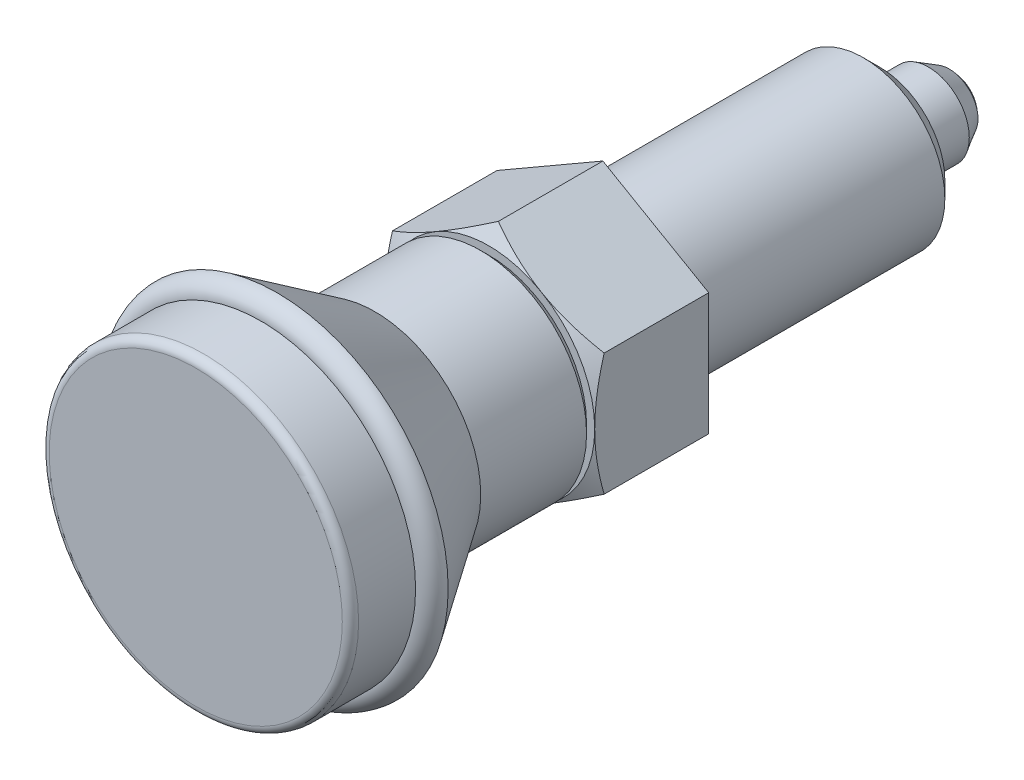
ISO-10303-21;
HEADER;
FILE_DESCRIPTION(('STEP AP214'),'2;1');
FILE_NAME('part.step','',(''),(''),'','','');
FILE_SCHEMA(('AUTOMOTIVE_DESIGN { 1 0 10303 214 1 1 1 1 }'));
ENDSEC;
DATA;
#1=APPLICATION_CONTEXT('core data for automotive mechanical design processes');
#2=APPLICATION_PROTOCOL_DEFINITION('international standard','automotive_design',2000,#1);
#3=PRODUCT_CONTEXT('',#1,'mechanical');
#4=PRODUCT('Part','Part','',(#3));
#5=PRODUCT_RELATED_PRODUCT_CATEGORY('part','',(#4));
#6=PRODUCT_DEFINITION_FORMATION('','',#4);
#7=PRODUCT_DEFINITION_CONTEXT('part definition',#1,'design');
#8=PRODUCT_DEFINITION('design','',#6,#7);
#9=PRODUCT_DEFINITION_SHAPE('','',#8);
#10=(LENGTH_UNIT() NAMED_UNIT(*) SI_UNIT(.MILLI.,.METRE.));
#11=(NAMED_UNIT(*) PLANE_ANGLE_UNIT() SI_UNIT($,.RADIAN.));
#12=(NAMED_UNIT(*) SI_UNIT($,.STERADIAN.) SOLID_ANGLE_UNIT());
#13=UNCERTAINTY_MEASURE_WITH_UNIT(LENGTH_MEASURE(1.E-05),#10,'distance_accuracy_value','');
#14=(GEOMETRIC_REPRESENTATION_CONTEXT(3) GLOBAL_UNCERTAINTY_ASSIGNED_CONTEXT((#13)) GLOBAL_UNIT_ASSIGNED_CONTEXT((#10,
#11,#12)) REPRESENTATION_CONTEXT('',''));
#15=CARTESIAN_POINT('',(0.,0.,0.));
#16=DIRECTION('',(0.,0.,1.));
#17=DIRECTION('',(1.,0.,0.));
#18=AXIS2_PLACEMENT_3D('',#15,#16,#17);
#19=CARTESIAN_POINT('',(2.59480249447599E-10,-1.49809602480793E-10,7.));
#20=DIRECTION('',(-3.70686070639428E-11,2.14013717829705E-11,-1.));
#21=DIRECTION('',(-1.,0.,3.70686070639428E-11));
#22=AXIS2_PLACEMENT_3D('',#19,#20,#21);
#23=CONICAL_SURFACE('',#22,6.49999999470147,1.0471975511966);
#24=CARTESIAN_POINT('',(6.50020000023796,3.75266127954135,6.41937674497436));
#25=CARTESIAN_POINT('',(6.35732254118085,3.83515161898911,6.46699557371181));
#26=CARTESIAN_POINT('',(6.2139123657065,3.91794952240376,6.51245329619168));
#27=CARTESIAN_POINT('',(5.92592736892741,4.08421773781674,6.59845131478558));
#28=CARTESIAN_POINT('',(5.78135207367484,4.16768832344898,6.63898948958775));
#29=CARTESIAN_POINT('',(5.34531134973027,4.41943655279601,6.75242899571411));
#30=CARTESIAN_POINT('',(5.05212471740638,4.58870793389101,6.81695218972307));
#31=CARTESIAN_POINT('',(4.61337625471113,4.84201947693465,6.89261341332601));
#32=CARTESIAN_POINT('',(4.46912536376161,4.9253027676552,6.91416714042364));
#33=CARTESIAN_POINT('',(4.17997178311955,5.09224566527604,6.9503096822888));
#34=CARTESIAN_POINT('',(4.03506915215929,5.17590523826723,6.96489911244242));
#35=CARTESIAN_POINT('',(3.74501222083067,5.34336968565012,6.98674124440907));
#36=CARTESIAN_POINT('',(3.59985839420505,5.42717428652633,6.99400227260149));
#37=CARTESIAN_POINT('',(3.30942466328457,5.59485627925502,7.00103969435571));
#38=CARTESIAN_POINT('',(3.16414476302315,5.67873366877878,7.00081631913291));
#39=CARTESIAN_POINT('',(2.76612405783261,5.90853103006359,6.98991653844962));
#40=CARTESIAN_POINT('',(2.51351353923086,6.05437578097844,6.97161817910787));
#41=CARTESIAN_POINT('',(2.0099703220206,6.3450965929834,6.9135936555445));
#42=CARTESIAN_POINT('',(1.75903939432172,6.48997163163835,6.87384765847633));
#43=CARTESIAN_POINT('',(1.2544827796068,6.78127752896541,6.77449409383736));
#44=CARTESIAN_POINT('',(1.00092075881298,6.92767162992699,6.71446557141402));
#45=CARTESIAN_POINT('',(0.497578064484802,7.21827666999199,6.57822500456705));
#46=CARTESIAN_POINT('',(0.24779094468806,7.36249133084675,6.50204496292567));
#47=CARTESIAN_POINT('',(-0.000199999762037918,7.5056689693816,6.41937674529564));
#48=B_SPLINE_CURVE_WITH_KNOTS('',3,(#24,#25,#26,#27,#28,#29,#30,#31,#32,#33,#34,#35,#36,#37,#38,
#39,#40,#41,#42,#43,#44,#45,#46,#47),.UNSPECIFIED.,.F.,.F.,(4,2,2,2,2,2,2,2,2,2,2,4),(0.,
0.51510505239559,1.03043143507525,2.06322554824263,2.56697389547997,3.07067772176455,
3.57380860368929,4.07692394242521,4.95279354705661,5.82947446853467,6.72559912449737,
7.61996451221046),.UNSPECIFIED.);
#49=CARTESIAN_POINT('',(3.25000000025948,5.62916512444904,7.));
#50=VERTEX_POINT('',#49);
#51=CARTESIAN_POINT('',(0.,7.50555349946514,6.41944341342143));
#52=VERTEX_POINT('',#51);
#53=EDGE_CURVE('E103',#50,#52,#48,.T.);
#54=ORIENTED_EDGE('',*,*,#53,.T.);
#55=CARTESIAN_POINT('',(0.000200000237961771,7.5056689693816,6.41937674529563));
#56=CARTESIAN_POINT('',(-0.142677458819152,7.42317862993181,6.46699557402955));
#57=CARTESIAN_POINT('',(-0.286087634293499,7.34038072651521,6.51245329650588));
#58=CARTESIAN_POINT('',(-0.574072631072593,7.17411251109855,6.59845131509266));
#59=CARTESIAN_POINT('',(-0.71864792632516,7.09064192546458,6.63898948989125));
#60=CARTESIAN_POINT('',(-1.15468865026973,6.83889369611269,6.75242899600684));
#61=CARTESIAN_POINT('',(-1.44787528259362,6.66962231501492,6.81695219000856));
#62=CARTESIAN_POINT('',(-1.88662374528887,6.41631077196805,6.89261341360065));
#63=CARTESIAN_POINT('',(-2.03087463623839,6.33302748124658,6.91416714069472));
#64=CARTESIAN_POINT('',(-2.32002821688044,6.1660845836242,6.95030968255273));
#65=CARTESIAN_POINT('',(-2.46493084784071,6.08242501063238,6.96489911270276));
#66=CARTESIAN_POINT('',(-2.75498777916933,5.91496056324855,6.98674124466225));
#67=CARTESIAN_POINT('',(-2.90014160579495,5.83115596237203,6.99400227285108));
#68=CARTESIAN_POINT('',(-3.19057533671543,5.66347396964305,7.00103969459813));
#69=CARTESIAN_POINT('',(-3.33585523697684,5.57959658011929,7.00081631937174));
#70=CARTESIAN_POINT('',(-3.73387594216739,5.34979921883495,6.98991653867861));
#71=CARTESIAN_POINT('',(-3.98648646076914,5.20395446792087,6.97161817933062));
#72=CARTESIAN_POINT('',(-4.4900296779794,4.9132336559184,6.91359365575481));
#73=CARTESIAN_POINT('',(-4.74096060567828,4.76835861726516,6.87384765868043));
#74=CARTESIAN_POINT('',(-5.2455172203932,4.47705271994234,6.774494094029));
#75=CARTESIAN_POINT('',(-5.49907924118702,4.33065861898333,6.71446557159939));
#76=CARTESIAN_POINT('',(-6.0024219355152,4.04005357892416,6.57822500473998));
#77=CARTESIAN_POINT('',(-6.25220905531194,3.89583891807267,6.50204496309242));
#78=CARTESIAN_POINT('',(-6.50019999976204,3.75266127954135,6.41937674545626));
#79=B_SPLINE_CURVE_WITH_KNOTS('',3,(#55,#56,#57,#58,#59,#60,#61,#62,#63,#64,#65,#66,#67,#68,#69,
#70,#71,#72,#73,#74,#75,#76,#77,#78),.UNSPECIFIED.,.F.,.F.,(4,2,2,2,2,2,2,2,2,2,2,4),(0.,
0.515105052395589,1.03043143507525,2.06322554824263,2.56697389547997,3.07067772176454,
3.57380860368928,4.07692394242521,4.95279354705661,5.82947446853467,6.72559912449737,
7.61996451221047),.UNSPECIFIED.);
#80=CARTESIAN_POINT('',(-3.24999999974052,5.62916512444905,7.00000000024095));
#81=VERTEX_POINT('',#80);
#82=EDGE_CURVE('E93',#52,#81,#79,.T.);
#83=ORIENTED_EDGE('',*,*,#82,.T.);
#84=CARTESIAN_POINT('',(2.59480249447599E-10,-1.49809602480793E-10,7.));
#85=DIRECTION('',(3.70686070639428E-11,-2.14013717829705E-11,1.));
#86=DIRECTION('',(1.,0.,-3.70686070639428E-11));
#87=AXIS2_PLACEMENT_3D('',#84,#85,#86);
#88=CIRCLE('',#87,6.49999999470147);
#89=EDGE_CURVE('E269',#50,#81,#88,.T.);
#90=ORIENTED_EDGE('',*,*,#89,.F.);
#91=EDGE_LOOP('',(#54,#83,#90));
#92=FACE_BOUND('',#91,.T.);
#93=ADVANCED_FACE('F15',(#92),#23,.T.);
#94=CARTESIAN_POINT('',(-6.49999999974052,-1.4980960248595E-10,7.00000000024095));
#95=VERTEX_POINT('',#94);
#96=EDGE_CURVE('E277',#81,#95,#88,.T.);
#97=ORIENTED_EDGE('',*,*,#96,.F.);
#98=CARTESIAN_POINT('',(-6.49999999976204,3.75277674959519,6.41944341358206));
#99=VERTEX_POINT('',#98);
#100=EDGE_CURVE('E192',#81,#99,#79,.T.);
#101=ORIENTED_EDGE('',*,*,#100,.T.);
#102=CARTESIAN_POINT('',(-6.49999999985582,-9.95291698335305,3.88957641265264));
#103=CARTESIAN_POINT('',(-6.49999999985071,-9.66753022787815,4.02749105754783));
#104=CARTESIAN_POINT('',(-6.49999999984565,-9.38146872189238,4.16403471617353));
#105=CARTESIAN_POINT('',(-6.49999999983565,-8.80763137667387,4.43359663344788));
#106=CARTESIAN_POINT('',(-6.49999999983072,-8.51985525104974,4.56661428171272));
#107=CARTESIAN_POINT('',(-6.499999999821,-7.94066929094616,4.82904149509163));
#108=CARTESIAN_POINT('',(-6.4999999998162,-7.64924808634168,4.95842605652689));
#109=CARTESIAN_POINT('',(-6.49999999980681,-7.06401043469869,5.21163779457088));
#110=CARTESIAN_POINT('',(-6.49999999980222,-6.77019411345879,5.33546526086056));
#111=CARTESIAN_POINT('',(-6.49999999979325,-6.1760515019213,5.57755519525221));
#112=CARTESIAN_POINT('',(-6.49999999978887,-5.87568957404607,5.69573067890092));
#113=CARTESIAN_POINT('',(-6.49999999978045,-5.27142269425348,5.92282610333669));
#114=CARTESIAN_POINT('',(-6.49999999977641,-4.96751735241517,6.03174501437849));
#115=CARTESIAN_POINT('',(-6.49999999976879,-4.3563054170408,6.23740097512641));
#116=CARTESIAN_POINT('',(-6.4999999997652,-4.04900762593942,6.33416392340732));
#117=CARTESIAN_POINT('',(-6.4999999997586,-3.43004022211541,6.51236428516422));
#118=CARTESIAN_POINT('',(-6.49999999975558,-3.11837202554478,6.59380654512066));
#119=CARTESIAN_POINT('',(-6.49999999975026,-2.49046594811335,6.73741591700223));
#120=CARTESIAN_POINT('',(-6.49999999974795,-2.1742268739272,6.79957789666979));
#121=CARTESIAN_POINT('',(-6.49999999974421,-1.53789167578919,6.9004257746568));
#122=CARTESIAN_POINT('',(-6.49999999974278,-1.21779554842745,6.93911165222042));
#123=CARTESIAN_POINT('',(-6.49999999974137,-0.737141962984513,6.97705343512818));
#124=CARTESIAN_POINT('',(-6.49999999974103,-0.577336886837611,6.98635478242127));
#125=CARTESIAN_POINT('',(-6.49999999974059,-0.257468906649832,6.99818590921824));
#126=CARTESIAN_POINT('',(-6.49999999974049,-0.0974060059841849,7.00071577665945));
#127=CARTESIAN_POINT('',(-6.49999999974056,0.222635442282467,6.99893598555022));
#128=CARTESIAN_POINT('',(-6.49999999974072,0.382614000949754,6.99462824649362));
#129=CARTESIAN_POINT('',(-6.49999999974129,0.702250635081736,6.97928241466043));
#130=CARTESIAN_POINT('',(-6.4999999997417,0.86190869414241,6.96824398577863));
#131=CARTESIAN_POINT('',(-6.49999999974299,1.24887053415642,6.933563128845));
#132=CARTESIAN_POINT('',(-6.49999999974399,1.47587694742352,6.90654811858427));
#133=CARTESIAN_POINT('',(-6.49999999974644,1.92815030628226,6.84041010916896));
#134=CARTESIAN_POINT('',(-6.49999999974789,2.15341675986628,6.8012838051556));
#135=CARTESIAN_POINT('',(-6.49999999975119,2.6020242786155,6.71231082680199));
#136=CARTESIAN_POINT('',(-6.49999999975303,2.82536331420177,6.66245401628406));
#137=CARTESIAN_POINT('',(-6.49999999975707,3.26974354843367,6.55354123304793));
#138=CARTESIAN_POINT('',(-6.49999999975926,3.49078496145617,6.49448612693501));
#139=CARTESIAN_POINT('',(-6.49999999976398,3.93601414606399,6.36704588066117));
#140=CARTESIAN_POINT('',(-6.49999999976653,4.16014622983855,6.2984675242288));
#141=CARTESIAN_POINT('',(-6.49999999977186,4.60604131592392,6.15453487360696));
#142=CARTESIAN_POINT('',(-6.49999999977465,4.82780583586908,6.07918525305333));
#143=CARTESIAN_POINT('',(-6.49999999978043,5.26807593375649,5.9232664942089));
#144=CARTESIAN_POINT('',(-6.49999999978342,5.48659282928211,5.84272912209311));
#145=CARTESIAN_POINT('',(-6.49999999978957,5.92193123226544,5.67692729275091));
#146=CARTESIAN_POINT('',(-6.49999999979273,6.13875201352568,5.59166092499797));
#147=CARTESIAN_POINT('',(-6.49999999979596,6.35478510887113,5.50449786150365));
#148=B_SPLINE_CURVE_WITH_KNOTS('',3,(#102,#103,#104,#105,#106,#107,#108,#109,#110,#111,#112,
#113,#114,#115,#116,#117,#118,#119,#120,#121,#122,#123,#124,#125,#126,#127,#128,#129,#130,#131,
#132,#133,#134,#135,#136,#137,#138,#139,#140,#141,#142,#143,#144,#145,#146,#147),.UNSPECIFIED.,
.F.,.F.,(4,2,2,2,2,2,2,2,2,2,2,2,2,2,2,2,2,2,2,2,2,2,4),(0.,0.950904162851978,1.90197187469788,
2.85848216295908,3.81494253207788,4.78314526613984,5.75145556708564,6.71766655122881,
7.68357137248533,8.64973308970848,9.61589566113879,10.0960003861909,10.5760988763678,
11.0560626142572,11.5360503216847,12.2214931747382,12.9071232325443,13.5934038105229,
14.2796197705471,14.9826563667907,15.6852113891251,16.3838119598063,17.0826968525),.UNSPECIFIED.);
#149=EDGE_CURVE('E191',#99,#95,#148,.F.);
#150=ORIENTED_EDGE('',*,*,#149,.T.);
#151=EDGE_LOOP('',(#97,#101,#150));
#152=FACE_BOUND('',#151,.T.);
#153=ADVANCED_FACE('F237',(#152),#23,.T.);
#154=CARTESIAN_POINT('',(-3.24999999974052,-5.62916512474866,7.));
#155=VERTEX_POINT('',#154);
#156=EDGE_CURVE('E286',#95,#155,#88,.T.);
#157=ORIENTED_EDGE('',*,*,#156,.F.);
#158=CARTESIAN_POINT('',(-6.49999999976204,-3.75277674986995,6.41944341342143));
#159=VERTEX_POINT('',#158);
#160=EDGE_CURVE('E183',#95,#159,#148,.F.);
#161=ORIENTED_EDGE('',*,*,#160,.T.);
#162=CARTESIAN_POINT('',(-6.50019999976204,-3.75266127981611,6.41937674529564));
#163=CARTESIAN_POINT('',(-6.3573225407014,-3.8351516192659,6.46699557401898));
#164=CARTESIAN_POINT('',(-6.21391236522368,-3.91794952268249,6.51245329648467));
#165=CARTESIAN_POINT('',(-5.92592736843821,-4.08421773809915,6.59845131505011));
#166=CARTESIAN_POINT('',(-5.78135207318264,-4.16768832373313,6.63898948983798));
#167=CARTESIAN_POINT('',(-5.34531134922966,-4.41943655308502,6.75242899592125));
#168=CARTESIAN_POINT('',(-5.05212471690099,-4.58870793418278,6.81695218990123));
#169=CARTESIAN_POINT('',(-4.61337625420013,-4.84201947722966,6.89261341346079));
#170=CARTESIAN_POINT('',(-4.46912536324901,-4.92530276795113,6.91416714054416));
#171=CARTESIAN_POINT('',(-4.17997178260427,-5.09224566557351,6.95030968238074));
#172=CARTESIAN_POINT('',(-4.03506915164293,-5.17590523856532,6.96489911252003));
#173=CARTESIAN_POINT('',(-3.74501222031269,-5.34336968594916,6.98674124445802));
#174=CARTESIAN_POINT('',(-3.59985839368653,-5.42717428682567,6.99400227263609));
#175=CARTESIAN_POINT('',(-3.30942466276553,-5.59485627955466,7.0010396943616));
#176=CARTESIAN_POINT('',(-3.16414476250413,-5.67873366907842,7.00081631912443));
#177=CARTESIAN_POINT('',(-2.7661240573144,-5.90853103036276,6.98991653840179));
#178=CARTESIAN_POINT('',(-2.513513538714,-6.05437578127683,6.97161817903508));
#179=CARTESIAN_POINT('',(-2.00997032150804,-6.3450965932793,6.91359365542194));
#180=CARTESIAN_POINT('',(-1.75903939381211,-6.48997163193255,6.87384765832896));
#181=CARTESIAN_POINT('',(-1.25448277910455,-6.78127752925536,6.77449409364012));
#182=CARTESIAN_POINT('',(-1.00092075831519,-6.92767163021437,6.71446557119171));
#183=CARTESIAN_POINT('',(-0.497578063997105,-7.21827667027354,6.57822500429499));
#184=CARTESIAN_POINT('',(-0.247790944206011,-7.36249133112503,6.50204496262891));
#185=CARTESIAN_POINT('',(0.00020000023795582,-7.50566896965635,6.41937674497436));
#186=B_SPLINE_CURVE_WITH_KNOTS('',3,(#162,#163,#164,#165,#166,#167,#168,#169,#170,#171,#172,
#173,#174,#175,#176,#177,#178,#179,#180,#181,#182,#183,#184,#185),.UNSPECIFIED.,.F.,.F.,(4,2,2,
2,2,2,2,2,2,2,2,4),(0.,0.51510505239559,1.03043143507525,2.06322554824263,2.56697389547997,
3.07067772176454,3.57380860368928,4.07692394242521,4.95279354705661,5.82947446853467,
6.72559912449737,7.61996451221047),.UNSPECIFIED.);
#187=EDGE_CURVE('E182',#159,#155,#186,.T.);
#188=ORIENTED_EDGE('',*,*,#187,.T.);
#189=EDGE_LOOP('',(#157,#161,#188));
#190=FACE_BOUND('',#189,.T.);
#191=ADVANCED_FACE('F244',(#190),#23,.T.);
#192=CARTESIAN_POINT('',(3.25000000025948,-5.62916512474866,6.99999999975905));
#193=VERTEX_POINT('',#192);
#194=EDGE_CURVE('E280',#155,#193,#88,.T.);
#195=ORIENTED_EDGE('',*,*,#194,.F.);
#196=CARTESIAN_POINT('',(2.37958188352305E-10,-7.50555349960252,6.41944341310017));
#197=VERTEX_POINT('',#196);
#198=EDGE_CURVE('E174',#155,#197,#186,.T.);
#199=ORIENTED_EDGE('',*,*,#198,.T.);
#200=CARTESIAN_POINT('',(-0.000199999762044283,-7.50566896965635,6.41937674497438));
#201=CARTESIAN_POINT('',(0.142677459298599,-7.4231786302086,6.46699557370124));
#202=CARTESIAN_POINT('',(0.286087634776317,-7.34038072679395,6.51245329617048));
#203=CARTESIAN_POINT('',(0.574072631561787,-7.17411251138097,6.59845131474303));
#204=CARTESIAN_POINT('',(0.718647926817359,-7.09064192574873,6.63898948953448));
#205=CARTESIAN_POINT('',(1.15468865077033,-6.8388936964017,6.75242899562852));
#206=CARTESIAN_POINT('',(1.44787528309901,-6.6696223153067,6.81695218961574));
#207=CARTESIAN_POINT('',(1.88662374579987,-6.41631077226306,6.89261341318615));
#208=CARTESIAN_POINT('',(2.03087463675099,-6.33302748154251,6.91416714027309));
#209=CARTESIAN_POINT('',(2.32002821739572,-6.16608458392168,6.95030968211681));
#210=CARTESIAN_POINT('',(2.46493084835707,-6.08242501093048,6.96489911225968));
#211=CARTESIAN_POINT('',(2.75498777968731,-5.91496056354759,6.98674124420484));
#212=CARTESIAN_POINT('',(2.90014160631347,-5.83115596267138,6.99400227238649));
#213=CARTESIAN_POINT('',(3.19057533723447,-5.6634739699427,7.00103969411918));
#214=CARTESIAN_POINT('',(3.33585523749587,-5.57959658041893,7.0008163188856));
#215=CARTESIAN_POINT('',(3.7338759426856,-5.34979921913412,6.98991653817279));
#216=CARTESIAN_POINT('',(3.986486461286,-5.20395446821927,6.97161817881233));
#217=CARTESIAN_POINT('',(4.49002967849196,-4.91323365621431,6.91359365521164));
#218=CARTESIAN_POINT('',(4.74096060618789,-4.76835861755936,6.87384765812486));
#219=CARTESIAN_POINT('',(5.24551722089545,-4.4770527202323,6.77449409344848));
#220=CARTESIAN_POINT('',(5.49907924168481,-4.33065861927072,6.71446557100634));
#221=CARTESIAN_POINT('',(6.00242193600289,-4.04005357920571,6.57822500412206));
#222=CARTESIAN_POINT('',(6.25220905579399,-3.89583891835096,6.50204496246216));
#223=CARTESIAN_POINT('',(6.50020000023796,-3.75266127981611,6.41937674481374));
#224=B_SPLINE_CURVE_WITH_KNOTS('',3,(#200,#201,#202,#203,#204,#205,#206,#207,#208,#209,#210,
#211,#212,#213,#214,#215,#216,#217,#218,#219,#220,#221,#222,#223),.UNSPECIFIED.,.F.,.F.,(4,2,2,
2,2,2,2,2,2,2,2,4),(0.,0.515105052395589,1.03043143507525,2.06322554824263,2.56697389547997,
3.07067772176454,3.57380860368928,4.07692394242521,4.95279354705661,5.82947446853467,
6.72559912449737,7.61996451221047),.UNSPECIFIED.);
#225=EDGE_CURVE('E172',#197,#193,#224,.T.);
#226=ORIENTED_EDGE('',*,*,#225,.T.);
#227=EDGE_LOOP('',(#195,#199,#226));
#228=FACE_BOUND('',#227,.T.);
#229=ADVANCED_FACE('F256',(#228),#23,.T.);
#230=CARTESIAN_POINT('',(6.50000000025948,-1.49809602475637E-10,6.99999999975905));
#231=VERTEX_POINT('',#230);
#232=EDGE_CURVE('E271',#193,#231,#88,.T.);
#233=ORIENTED_EDGE('',*,*,#232,.F.);
#234=CARTESIAN_POINT('',(6.50000000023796,-3.75277674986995,6.41944341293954));
#235=VERTEX_POINT('',#234);
#236=EDGE_CURVE('E164',#193,#235,#224,.T.);
#237=ORIENTED_EDGE('',*,*,#236,.T.);
#238=CARTESIAN_POINT('',(6.50000000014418,-9.95291698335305,3.88957641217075));
#239=CARTESIAN_POINT('',(6.50000000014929,-9.66753022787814,4.02749105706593));
#240=CARTESIAN_POINT('',(6.50000000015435,-9.38146872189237,4.16403471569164));
#241=CARTESIAN_POINT('',(6.50000000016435,-8.80763137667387,4.43359663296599));
#242=CARTESIAN_POINT('',(6.50000000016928,-8.51985525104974,4.56661428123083));
#243=CARTESIAN_POINT('',(6.500000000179,-7.94066929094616,4.82904149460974));
#244=CARTESIAN_POINT('',(6.5000000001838,-7.64924808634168,4.958426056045));
#245=CARTESIAN_POINT('',(6.50000000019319,-7.06401043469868,5.21163779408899));
#246=CARTESIAN_POINT('',(6.50000000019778,-6.77019411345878,5.33546526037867));
#247=CARTESIAN_POINT('',(6.50000000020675,-6.17605150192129,5.57755519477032));
#248=CARTESIAN_POINT('',(6.50000000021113,-5.87568957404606,5.69573067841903));
#249=CARTESIAN_POINT('',(6.50000000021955,-5.27142269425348,5.9228261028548));
#250=CARTESIAN_POINT('',(6.50000000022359,-4.96751735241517,6.0317450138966));
#251=CARTESIAN_POINT('',(6.50000000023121,-4.3563054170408,6.23740097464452));
#252=CARTESIAN_POINT('',(6.5000000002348,-4.04900762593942,6.33416392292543));
#253=CARTESIAN_POINT('',(6.5000000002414,-3.43004022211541,6.51236428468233));
#254=CARTESIAN_POINT('',(6.50000000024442,-3.11837202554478,6.59380654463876));
#255=CARTESIAN_POINT('',(6.50000000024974,-2.49046594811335,6.73741591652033));
#256=CARTESIAN_POINT('',(6.50000000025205,-2.17422687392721,6.7995778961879));
#257=CARTESIAN_POINT('',(6.50000000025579,-1.53789167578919,6.90042577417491));
#258=CARTESIAN_POINT('',(6.50000000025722,-1.21779554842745,6.93911165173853));
#259=CARTESIAN_POINT('',(6.50000000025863,-0.737141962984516,6.97705343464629));
#260=CARTESIAN_POINT('',(6.50000000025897,-0.577336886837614,6.98635478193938));
#261=CARTESIAN_POINT('',(6.50000000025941,-0.257468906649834,6.99818590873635));
#262=CARTESIAN_POINT('',(6.5000000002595,-0.0974060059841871,7.00071577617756));
#263=CARTESIAN_POINT('',(6.50000000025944,0.222635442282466,6.99893598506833));
#264=CARTESIAN_POINT('',(6.50000000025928,0.382614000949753,6.99462824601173));
#265=CARTESIAN_POINT('',(6.50000000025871,0.702250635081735,6.97928241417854));
#266=CARTESIAN_POINT('',(6.5000000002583,0.861908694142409,6.96824398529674));
#267=CARTESIAN_POINT('',(6.50000000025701,1.24887053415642,6.93356312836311));
#268=CARTESIAN_POINT('',(6.50000000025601,1.47587694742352,6.90654811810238));
#269=CARTESIAN_POINT('',(6.50000000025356,1.92815030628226,6.84041010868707));
#270=CARTESIAN_POINT('',(6.50000000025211,2.15341675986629,6.80128380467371));
#271=CARTESIAN_POINT('',(6.50000000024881,2.6020242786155,6.7123108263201));
#272=CARTESIAN_POINT('',(6.50000000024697,2.82536331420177,6.66245401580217));
#273=CARTESIAN_POINT('',(6.50000000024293,3.26974354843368,6.55354123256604));
#274=CARTESIAN_POINT('',(6.50000000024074,3.49078496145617,6.49448612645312));
#275=CARTESIAN_POINT('',(6.50000000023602,3.93601414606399,6.36704588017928));
#276=CARTESIAN_POINT('',(6.50000000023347,4.16014622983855,6.29846752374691));
#277=CARTESIAN_POINT('',(6.50000000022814,4.60604131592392,6.15453487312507));
#278=CARTESIAN_POINT('',(6.50000000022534,4.82780583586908,6.07918525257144));
#279=CARTESIAN_POINT('',(6.50000000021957,5.26807593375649,5.92326649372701));
#280=CARTESIAN_POINT('',(6.50000000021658,5.48659282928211,5.84272912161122));
#281=CARTESIAN_POINT('',(6.50000000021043,5.92193123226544,5.67692729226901));
#282=CARTESIAN_POINT('',(6.50000000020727,6.13875201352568,5.59166092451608));
#283=CARTESIAN_POINT('',(6.50000000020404,6.35478510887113,5.50449786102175));
#284=B_SPLINE_CURVE_WITH_KNOTS('',3,(#238,#239,#240,#241,#242,#243,#244,#245,#246,#247,#248,
#249,#250,#251,#252,#253,#254,#255,#256,#257,#258,#259,#260,#261,#262,#263,#264,#265,#266,#267,
#268,#269,#270,#271,#272,#273,#274,#275,#276,#277,#278,#279,#280,#281,#282,#283),.UNSPECIFIED.,
.F.,.F.,(4,2,2,2,2,2,2,2,2,2,2,2,2,2,2,2,2,2,2,2,2,2,4),(0.,0.950904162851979,1.90197187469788,
2.85848216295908,3.81494253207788,4.78314526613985,5.75145556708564,6.7176665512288,
7.68357137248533,8.64973308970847,9.61589566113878,10.0960003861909,10.5760988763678,
11.0560626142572,11.5360503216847,12.2214931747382,12.9071232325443,13.5934038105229,
14.2796197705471,14.9826563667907,15.6852113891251,16.3838119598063,17.0826968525),.UNSPECIFIED.);
#285=EDGE_CURVE('E173',#235,#231,#284,.T.);
#286=ORIENTED_EDGE('',*,*,#285,.T.);
#287=EDGE_LOOP('',(#233,#237,#286));
#288=FACE_BOUND('',#287,.T.);
#289=ADVANCED_FACE('F247',(#288),#23,.T.);
#290=EDGE_CURVE('E262',#231,#50,#88,.T.);
#291=ORIENTED_EDGE('',*,*,#290,.F.);
#292=CARTESIAN_POINT('',(6.50000000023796,3.75277674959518,6.41944341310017));
#293=VERTEX_POINT('',#292);
#294=EDGE_CURVE('E139',#231,#293,#284,.T.);
#295=ORIENTED_EDGE('',*,*,#294,.T.);
#296=EDGE_CURVE('E138',#293,#50,#48,.T.);
#297=ORIENTED_EDGE('',*,*,#296,.T.);
#298=EDGE_LOOP('',(#291,#295,#297));
#299=FACE_BOUND('',#298,.T.);
#300=ADVANCED_FACE('F239',(#299),#23,.T.);
#301=CARTESIAN_POINT('',(9.26715176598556E-10,8.99999999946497,25.0000000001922));
#302=DIRECTION('',(3.70686070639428E-11,-2.14013717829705E-11,1.));
#303=DIRECTION('',(1.,0.,-3.70686070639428E-11));
#304=AXIS2_PLACEMENT_3D('',#301,#302,#303);
#305=PLANE('',#304);
#306=CARTESIAN_POINT('',(9.26715176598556E-10,-5.35034294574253E-10,24.9999999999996));
#307=DIRECTION('',(3.70686070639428E-11,-2.14013717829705E-11,1.));
#308=DIRECTION('',(1.,0.,-3.70686070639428E-11));
#309=AXIS2_PLACEMENT_3D('',#306,#307,#308);
#310=CIRCLE('',#309,9.);
#311=CARTESIAN_POINT('',(9.00000000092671,-5.35034294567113E-10,24.999999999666));
#312=VERTEX_POINT('',#311);
#313=EDGE_CURVE('E9',#312,#312,#310,.T.);
#314=ORIENTED_EDGE('',*,*,#313,.T.);
#315=EDGE_LOOP('',(#314));
#316=FACE_BOUND('',#315,.T.);
#317=ADVANCED_FACE('F17',(#316),#305,.T.);
#318=CARTESIAN_POINT('',(9.08180873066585E-10,-5.24333608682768E-10,24.4999999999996));
#319=DIRECTION('',(3.70686070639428E-11,-2.14013717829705E-11,1.));
#320=DIRECTION('',(1.,0.,-3.70686070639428E-11));
#321=AXIS2_PLACEMENT_3D('',#318,#319,#320);
#322=TOROIDAL_SURFACE('',#321,9.,0.5);
#323=CARTESIAN_POINT('',(9.08180873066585E-10,-5.24333608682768E-10,24.4999999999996));
#324=DIRECTION('',(3.70686070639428E-11,-2.14013717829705E-11,1.));
#325=DIRECTION('',(1.,0.,-3.70686070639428E-11));
#326=AXIS2_PLACEMENT_3D('',#323,#324,#325);
#327=CIRCLE('',#326,9.5);
#328=CARTESIAN_POINT('',(9.50000000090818,-5.24333608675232E-10,24.4999999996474));
#329=VERTEX_POINT('',#328);
#330=EDGE_CURVE('E24',#329,#329,#327,.T.);
#331=ORIENTED_EDGE('',*,*,#330,.T.);
#332=EDGE_LOOP('',(#331));
#333=FACE_BOUND('',#332,.T.);
#334=ORIENTED_EDGE('',*,*,#313,.F.);
#335=EDGE_LOOP('',(#334));
#336=FACE_BOUND('',#335,.T.);
#337=ADVANCED_FACE('F254',(#333,#336),#322,.T.);
#338=CARTESIAN_POINT('',(9.26715176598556E-10,-5.35034294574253E-10,24.9999999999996));
#339=DIRECTION('',(3.70686070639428E-11,-2.14013717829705E-11,1.));
#340=DIRECTION('',(1.,0.,-3.70686070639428E-11));
#341=AXIS2_PLACEMENT_3D('',#338,#339,#340);
#342=CYLINDRICAL_SURFACE('',#341,9.5);
#343=CARTESIAN_POINT('',(7.78440748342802E-10,-4.49428807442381E-10,21.));
#344=DIRECTION('',(3.70686070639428E-11,-2.14013717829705E-11,1.));
#345=DIRECTION('',(1.,0.,-3.70686070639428E-11));
#346=AXIS2_PLACEMENT_3D('',#343,#344,#345);
#347=CIRCLE('',#346,9.5);
#348=CARTESIAN_POINT('',(9.50000000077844,-4.49428807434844E-10,20.9999999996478));
#349=VERTEX_POINT('',#348);
#350=EDGE_CURVE('E472',#349,#349,#347,.T.);
#351=ORIENTED_EDGE('',*,*,#350,.T.);
#352=EDGE_LOOP('',(#351));
#353=FACE_BOUND('',#352,.T.);
#354=ORIENTED_EDGE('',*,*,#330,.F.);
#355=EDGE_LOOP('',(#354));
#356=FACE_BOUND('',#355,.T.);
#357=ADVANCED_FACE('F442',(#353,#356),#342,.T.);
#358=CARTESIAN_POINT('',(7.41372141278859E-10,-4.28027435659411E-10,20.));
#359=DIRECTION('',(3.70686070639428E-11,-2.14013717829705E-11,1.));
#360=DIRECTION('',(1.,0.,-3.70686070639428E-11));
#361=AXIS2_PLACEMENT_3D('',#358,#359,#360);
#362=TOROIDAL_SURFACE('',#361,9.5,1.);
#363=CARTESIAN_POINT('',(7.41372141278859E-10,-4.28027435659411E-10,20.));
#364=DIRECTION('',(3.70686070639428E-11,-2.14013717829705E-11,1.));
#365=DIRECTION('',(1.,0.,-3.70686070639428E-11));
#366=AXIS2_PLACEMENT_3D('',#363,#364,#365);
#367=CIRCLE('',#366,10.5);
#368=CARTESIAN_POINT('',(10.5000000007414,-4.28027435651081E-10,19.9999999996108));
#369=VERTEX_POINT('',#368);
#370=EDGE_CURVE('E475',#369,#369,#367,.T.);
#371=ORIENTED_EDGE('',*,*,#370,.T.);
#372=EDGE_LOOP('',(#371));
#373=FACE_BOUND('',#372,.T.);
#374=ORIENTED_EDGE('',*,*,#350,.F.);
#375=EDGE_LOOP('',(#374));
#376=FACE_BOUND('',#375,.T.);
#377=ADVANCED_FACE('F432',(#373,#376),#362,.T.);
#378=CARTESIAN_POINT('',(7.41372141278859E-10,-4.28027435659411E-10,20.));
#379=DIRECTION('',(3.70686070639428E-11,-2.14013717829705E-11,1.));
#380=DIRECTION('',(1.,0.,-3.70686070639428E-11));
#381=AXIS2_PLACEMENT_3D('',#378,#379,#380);
#382=CONICAL_SURFACE('',#381,10.5,0.588002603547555);
#383=CARTESIAN_POINT('',(5.18960498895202E-10,-2.99619204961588E-10,14.));
#384=DIRECTION('',(3.70686070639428E-11,-2.14013717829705E-11,1.));
#385=DIRECTION('',(1.,0.,-3.70686070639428E-11));
#386=AXIS2_PLACEMENT_3D('',#383,#384,#385);
#387=CIRCLE('',#386,6.5);
#388=CARTESIAN_POINT('',(6.50000000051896,-2.99619204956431E-10,13.9999999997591));
#389=VERTEX_POINT('',#388);
#390=EDGE_CURVE('E481',#389,#389,#387,.T.);
#391=ORIENTED_EDGE('',*,*,#390,.T.);
#392=EDGE_LOOP('',(#391));
#393=FACE_BOUND('',#392,.T.);
#394=ORIENTED_EDGE('',*,*,#370,.F.);
#395=EDGE_LOOP('',(#394));
#396=FACE_BOUND('',#395,.T.);
#397=ADVANCED_FACE('F422',(#393,#396),#382,.T.);
#398=CARTESIAN_POINT('',(9.26715176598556E-10,-5.35034294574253E-10,24.9999999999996));
#399=DIRECTION('',(3.70686070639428E-11,-2.14013717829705E-11,1.));
#400=DIRECTION('',(1.,0.,-3.70686070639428E-11));
#401=AXIS2_PLACEMENT_3D('',#398,#399,#400);
#402=CYLINDRICAL_SURFACE('',#401,6.5);
#403=CARTESIAN_POINT('',(2.78014552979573E-10,-1.60510288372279E-10,7.5));
#404=DIRECTION('',(3.70686070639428E-11,-2.14013717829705E-11,1.));
#405=DIRECTION('',(1.,0.,-3.70686070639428E-11));
#406=AXIS2_PLACEMENT_3D('',#403,#404,#405);
#407=CIRCLE('',#406,6.5);
#408=CARTESIAN_POINT('',(6.50000000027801,-1.60510288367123E-10,7.49999999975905));
#409=VERTEX_POINT('',#408);
#410=EDGE_CURVE('E275',#409,#409,#407,.T.);
#411=ORIENTED_EDGE('',*,*,#410,.T.);
#412=EDGE_LOOP('',(#411));
#413=FACE_BOUND('',#412,.T.);
#414=ORIENTED_EDGE('',*,*,#390,.F.);
#415=EDGE_LOOP('',(#414));
#416=FACE_BOUND('',#415,.T.);
#417=ADVANCED_FACE('F412',(#413,#416),#402,.T.);
#418=CARTESIAN_POINT('',(2.78014552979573E-10,-1.60510288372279E-10,7.5));
#419=DIRECTION('',(3.70686070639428E-11,-2.14013717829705E-11,1.));
#420=DIRECTION('',(1.,0.,-3.70686070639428E-11));
#421=AXIS2_PLACEMENT_3D('',#418,#419,#420);
#422=CONICAL_SURFACE('',#421,6.5,0.785398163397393);
#423=CARTESIAN_POINT('',(2.59480249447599E-10,-1.49809602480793E-10,7.));
#424=DIRECTION('',(3.70686070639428E-11,-2.14013717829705E-11,1.));
#425=DIRECTION('',(1.,0.,-3.70686070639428E-11));
#426=AXIS2_PLACEMENT_3D('',#423,#424,#425);
#427=CIRCLE('',#426,6.);
#428=CARTESIAN_POINT('',(6.00000000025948,-1.49809602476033E-10,6.99999999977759));
#429=VERTEX_POINT('',#428);
#430=EDGE_CURVE('E268',#429,#429,#427,.T.);
#431=ORIENTED_EDGE('',*,*,#430,.T.);
#432=EDGE_LOOP('',(#431));
#433=FACE_BOUND('',#432,.T.);
#434=ORIENTED_EDGE('',*,*,#410,.F.);
#435=EDGE_LOOP('',(#434));
#436=FACE_BOUND('',#435,.T.);
#437=ADVANCED_FACE('F403',(#433,#436),#422,.T.);
#438=CARTESIAN_POINT('',(2.59480249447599E-10,6.49999999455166,7.00000000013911));
#439=DIRECTION('',(3.70686070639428E-11,-2.14013717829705E-11,1.));
#440=DIRECTION('',(1.,0.,-3.70686070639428E-11));
#441=AXIS2_PLACEMENT_3D('',#438,#439,#440);
#442=PLANE('',#441);
#443=ORIENTED_EDGE('',*,*,#290,.T.);
#444=ORIENTED_EDGE('',*,*,#89,.T.);
#445=ORIENTED_EDGE('',*,*,#96,.T.);
#446=ORIENTED_EDGE('',*,*,#156,.T.);
#447=ORIENTED_EDGE('',*,*,#194,.T.);
#448=ORIENTED_EDGE('',*,*,#232,.T.);
#449=EDGE_LOOP('',(#443,#444,#445,#446,#447,#448));
#450=FACE_BOUND('',#449,.T.);
#451=ORIENTED_EDGE('',*,*,#430,.F.);
#452=EDGE_LOOP('',(#451));
#453=FACE_BOUND('',#452,.T.);
#454=ADVANCED_FACE('F206',(#450,#453),#442,.T.);
#455=CARTESIAN_POINT('',(-6.49999999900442,3.75277674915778,26.8578280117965));
#456=DIRECTION('',(-0.5,0.866025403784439,3.70684351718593E-11));
#457=DIRECTION('',(-0.866025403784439,-0.5,2.14016695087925E-11));
#458=AXIS2_PLACEMENT_3D('',#455,#456,#457);
#459=PLANE('',#458);
#460=DIRECTION('',(-3.70686070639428E-11,2.14013717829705E-11,-1.));
#461=VECTOR('',#460,1.);
#462=CARTESIAN_POINT('',(9.95586609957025E-10,7.50555349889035,26.8578280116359));
#463=LINE('',#462,#461);
#464=CARTESIAN_POINT('',(0.,7.50555349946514,1.60628454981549E-10));
#465=VERTEX_POINT('',#464);
#466=EDGE_CURVE('E31',#52,#465,#463,.T.);
#467=ORIENTED_EDGE('',*,*,#466,.T.);
#468=DIRECTION('',(0.866025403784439,0.5,-2.14016695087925E-11));
#469=VECTOR('',#468,1.);
#470=CARTESIAN_POINT('',(-6.5,3.75277674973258,3.21260379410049E-10));
#471=LINE('',#470,#469);
#472=CARTESIAN_POINT('',(-6.5,3.75277674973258,3.21260379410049E-10));
#473=VERTEX_POINT('',#472);
#474=EDGE_CURVE('E90',#473,#465,#471,.T.);
#475=ORIENTED_EDGE('',*,*,#474,.F.);
#476=DIRECTION('',(-3.70686070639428E-11,2.14013717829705E-11,-1.));
#477=VECTOR('',#476,1.);
#478=CARTESIAN_POINT('',(-6.49999999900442,3.75277674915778,26.8578280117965));
#479=LINE('',#478,#477);
#480=EDGE_CURVE('E111',#99,#473,#479,.T.);
#481=ORIENTED_EDGE('',*,*,#480,.F.);
#482=ORIENTED_EDGE('',*,*,#100,.F.);
#483=ORIENTED_EDGE('',*,*,#82,.F.);
#484=EDGE_LOOP('',(#467,#475,#481,#482,#483));
#485=FACE_BOUND('',#484,.T.);
#486=ADVANCED_FACE('F87',(#485),#459,.T.);
#487=CARTESIAN_POINT('',(-6.49999999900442,-3.75277675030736,26.8578280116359));
#488=DIRECTION('',(-1.,0.,3.70686070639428E-11));
#489=DIRECTION('',(3.70686070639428E-11,-2.14013717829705E-11,1.));
#490=AXIS2_PLACEMENT_3D('',#487,#488,#489);
#491=PLANE('',#490);
#492=ORIENTED_EDGE('',*,*,#480,.T.);
#493=DIRECTION('',(0.,1.,2.14013717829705E-11));
#494=VECTOR('',#493,1.);
#495=CARTESIAN_POINT('',(-6.5,-3.75277674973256,1.606319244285E-10));
#496=LINE('',#495,#494);
#497=CARTESIAN_POINT('',(-6.5,-3.75277674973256,1.606319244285E-10));
#498=VERTEX_POINT('',#497);
#499=EDGE_CURVE('E108',#498,#473,#496,.T.);
#500=ORIENTED_EDGE('',*,*,#499,.F.);
#501=DIRECTION('',(-3.70686070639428E-11,2.14013717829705E-11,-1.));
#502=VECTOR('',#501,1.);
#503=CARTESIAN_POINT('',(-6.49999999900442,-3.75277675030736,26.8578280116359));
#504=LINE('',#503,#502);
#505=EDGE_CURVE('E110',#159,#498,#504,.T.);
#506=ORIENTED_EDGE('',*,*,#505,.F.);
#507=ORIENTED_EDGE('',*,*,#160,.F.);
#508=ORIENTED_EDGE('',*,*,#149,.F.);
#509=EDGE_LOOP('',(#492,#500,#506,#507,#508));
#510=FACE_BOUND('',#509,.T.);
#511=ADVANCED_FACE('F199',(#510),#491,.T.);
#512=CARTESIAN_POINT('',(9.9558063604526E-10,-7.50555350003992,26.8578280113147));
#513=DIRECTION('',(-0.5,-0.866025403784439,0.));
#514=DIRECTION('',(0.866025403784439,-0.5,-4.2803041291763E-11));
#515=AXIS2_PLACEMENT_3D('',#512,#513,#514);
#516=PLANE('',#515);
#517=ORIENTED_EDGE('',*,*,#505,.T.);
#518=DIRECTION('',(-0.866025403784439,0.5,4.2803041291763E-11));
#519=VECTOR('',#518,1.);
#520=CARTESIAN_POINT('',(0.,-7.50555349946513,-1.60628454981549E-10));
#521=LINE('',#520,#519);
#522=CARTESIAN_POINT('',(0.,-7.50555349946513,-1.60628454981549E-10));
#523=VERTEX_POINT('',#522);
#524=EDGE_CURVE('E123',#523,#498,#521,.T.);
#525=ORIENTED_EDGE('',*,*,#524,.F.);
#526=DIRECTION('',(-3.70686070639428E-11,2.14013717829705E-11,-1.));
#527=VECTOR('',#526,1.);
#528=CARTESIAN_POINT('',(9.9558063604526E-10,-7.50555350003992,26.8578280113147));
#529=LINE('',#528,#527);
#530=EDGE_CURVE('E120',#197,#523,#529,.T.);
#531=ORIENTED_EDGE('',*,*,#530,.F.);
#532=ORIENTED_EDGE('',*,*,#198,.F.);
#533=ORIENTED_EDGE('',*,*,#187,.F.);
#534=EDGE_LOOP('',(#517,#525,#531,#532,#533));
#535=FACE_BOUND('',#534,.T.);
#536=ADVANCED_FACE('F160',(#535),#516,.T.);
#537=CARTESIAN_POINT('',(6.50000000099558,-3.75277675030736,26.8578280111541));
#538=DIRECTION('',(0.5,-0.866025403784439,-3.70684351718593E-11));
#539=DIRECTION('',(0.866025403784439,0.5,-2.14016695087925E-11));
#540=AXIS2_PLACEMENT_3D('',#537,#538,#539);
#541=PLANE('',#540);
#542=ORIENTED_EDGE('',*,*,#530,.T.);
#543=DIRECTION('',(-0.866025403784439,-0.5,2.14016695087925E-11));
#544=VECTOR('',#543,1.);
#545=CARTESIAN_POINT('',(6.5,-3.75277674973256,-3.21260379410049E-10));
#546=LINE('',#545,#544);
#547=CARTESIAN_POINT('',(6.5,-3.75277674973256,-3.21260379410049E-10));
#548=VERTEX_POINT('',#547);
#549=EDGE_CURVE('E127',#548,#523,#546,.T.);
#550=ORIENTED_EDGE('',*,*,#549,.F.);
#551=DIRECTION('',(-3.70686070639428E-11,2.14013717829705E-11,-1.));
#552=VECTOR('',#551,1.);
#553=CARTESIAN_POINT('',(6.50000000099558,-3.75277675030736,26.8578280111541));
#554=LINE('',#553,#552);
#555=EDGE_CURVE('E124',#235,#548,#554,.T.);
#556=ORIENTED_EDGE('',*,*,#555,.F.);
#557=ORIENTED_EDGE('',*,*,#236,.F.);
#558=ORIENTED_EDGE('',*,*,#225,.F.);
#559=EDGE_LOOP('',(#542,#550,#556,#557,#558));
#560=FACE_BOUND('',#559,.T.);
#561=ADVANCED_FACE('F156',(#560),#541,.T.);
#562=CARTESIAN_POINT('',(6.50000000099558,3.75277674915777,26.8578280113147));
#563=DIRECTION('',(1.,0.,-3.70686070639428E-11));
#564=DIRECTION('',(-3.70686070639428E-11,2.14013717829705E-11,-1.));
#565=AXIS2_PLACEMENT_3D('',#562,#563,#564);
#566=PLANE('',#565);
#567=ORIENTED_EDGE('',*,*,#555,.T.);
#568=DIRECTION('',(0.,-1.,-2.14013717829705E-11));
#569=VECTOR('',#568,1.);
#570=CARTESIAN_POINT('',(6.5,3.75277674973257,-1.606319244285E-10));
#571=LINE('',#570,#569);
#572=CARTESIAN_POINT('',(6.50000000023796,3.75277674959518,-1.606319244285E-10));
#573=VERTEX_POINT('',#572);
#574=EDGE_CURVE('E39',#573,#548,#571,.T.);
#575=ORIENTED_EDGE('',*,*,#574,.F.);
#576=DIRECTION('',(-3.70686070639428E-11,2.14013717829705E-11,-1.));
#577=VECTOR('',#576,1.);
#578=CARTESIAN_POINT('',(6.50000000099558,3.75277674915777,26.8578280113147));
#579=LINE('',#578,#577);
#580=EDGE_CURVE('E100',#293,#573,#579,.T.);
#581=ORIENTED_EDGE('',*,*,#580,.F.);
#582=ORIENTED_EDGE('',*,*,#294,.F.);
#583=ORIENTED_EDGE('',*,*,#285,.F.);
#584=EDGE_LOOP('',(#567,#575,#581,#582,#583));
#585=FACE_BOUND('',#584,.T.);
#586=ADVANCED_FACE('F152',(#585),#566,.T.);
#587=CARTESIAN_POINT('',(9.95586609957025E-10,7.50555349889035,26.8578280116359));
#588=DIRECTION('',(0.5,0.866025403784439,0.));
#589=DIRECTION('',(-0.866025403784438,0.5,4.2803041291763E-11));
#590=AXIS2_PLACEMENT_3D('',#587,#588,#589);
#591=PLANE('',#590);
#592=ORIENTED_EDGE('',*,*,#580,.T.);
#593=DIRECTION('',(0.866025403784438,-0.5,-4.2803041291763E-11));
#594=VECTOR('',#593,1.);
#595=CARTESIAN_POINT('',(0.,7.50555349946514,1.60628454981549E-10));
#596=LINE('',#595,#594);
#597=EDGE_CURVE('E96',#465,#573,#596,.T.);
#598=ORIENTED_EDGE('',*,*,#597,.F.);
#599=ORIENTED_EDGE('',*,*,#466,.F.);
#600=ORIENTED_EDGE('',*,*,#53,.F.);
#601=ORIENTED_EDGE('',*,*,#296,.F.);
#602=EDGE_LOOP('',(#592,#598,#599,#600,#601));
#603=FACE_BOUND('',#602,.T.);
#604=ADVANCED_FACE('F99',(#603),#591,.T.);
#605=CARTESIAN_POINT('',(-7.228378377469E-10,4.17326749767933E-10,-19.5000000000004));
#606=DIRECTION('',(3.70686070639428E-11,-2.14013717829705E-11,1.));
#607=DIRECTION('',(0.,1.,2.14013717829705E-11));
#608=AXIS2_PLACEMENT_3D('',#605,#606,#607);
#609=SPHERICAL_SURFACE('',#608,2.50000000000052);
#610=CARTESIAN_POINT('',(-7.88341261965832E-10,4.55144818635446E-10,-21.2670862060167));
#611=DIRECTION('',(3.70686070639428E-11,-2.14013717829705E-11,1.));
#612=DIRECTION('',(1.,0.,-3.70686070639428E-11));
#613=AXIS2_PLACEMENT_3D('',#610,#611,#612);
#614=CIRCLE('',#613,1.76844743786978);
#615=CARTESIAN_POINT('',(1.76844743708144,4.55144818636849E-10,-21.2670862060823));
#616=VERTEX_POINT('',#615);
#617=EDGE_CURVE('E304',#616,#616,#614,.T.);
#618=ORIENTED_EDGE('',*,*,#617,.F.);
#619=EDGE_LOOP('',(#618));
#620=FACE_BOUND('',#619,.T.);
#621=ADVANCED_FACE('F151',(#620),#609,.T.);
#622=CARTESIAN_POINT('',(-7.41372141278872E-10,4.28027435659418E-10,-20.0000000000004));
#623=DIRECTION('',(3.70686070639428E-11,-2.14013717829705E-11,1.));
#624=DIRECTION('',(1.,0.,-3.70686070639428E-11));
#625=AXIS2_PLACEMENT_3D('',#622,#623,#624);
#626=CONICAL_SURFACE('',#625,2.5,0.52359877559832);
#627=ORIENTED_EDGE('',*,*,#617,.T.);
#628=EDGE_LOOP('',(#627));
#629=FACE_BOUND('',#628,.T.);
#630=CARTESIAN_POINT('',(-7.41372141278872E-10,4.28027435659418E-10,-20.0000000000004));
#631=DIRECTION('',(3.70686070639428E-11,-2.14013717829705E-11,1.));
#632=DIRECTION('',(1.,0.,-3.70686070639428E-11));
#633=AXIS2_PLACEMENT_3D('',#630,#631,#632);
#634=CIRCLE('',#633,2.5);
#635=CARTESIAN_POINT('',(2.49999999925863,4.28027435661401E-10,-20.0000000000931));
#636=VERTEX_POINT('',#635);
#637=EDGE_CURVE('E301',#636,#636,#634,.T.);
#638=ORIENTED_EDGE('',*,*,#637,.F.);
#639=EDGE_LOOP('',(#638));
#640=FACE_BOUND('',#639,.T.);
#641=ADVANCED_FACE('F209',(#629,#640),#626,.T.);
#642=CARTESIAN_POINT('',(9.26715176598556E-10,-5.35034294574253E-10,24.9999999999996));
#643=DIRECTION('',(3.70686070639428E-11,-2.14013717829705E-11,1.));
#644=DIRECTION('',(1.,0.,-3.70686070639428E-11));
#645=AXIS2_PLACEMENT_3D('',#642,#643,#644);
#646=CYLINDRICAL_SURFACE('',#645,2.5);
#647=ORIENTED_EDGE('',*,*,#637,.T.);
#648=EDGE_LOOP('',(#647));
#649=FACE_BOUND('',#648,.T.);
#650=CARTESIAN_POINT('',(-6.30166320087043E-10,3.63823320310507E-10,-17.0000000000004));
#651=DIRECTION('',(3.70686070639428E-11,-2.14013717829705E-11,1.));
#652=DIRECTION('',(1.,0.,-3.70686070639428E-11));
#653=AXIS2_PLACEMENT_3D('',#650,#651,#652);
#654=CIRCLE('',#653,2.5);
#655=CARTESIAN_POINT('',(2.49999999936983,3.6382332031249E-10,-17.0000000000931));
#656=VERTEX_POINT('',#655);
#657=EDGE_CURVE('E297',#656,#656,#654,.T.);
#658=ORIENTED_EDGE('',*,*,#657,.F.);
#659=EDGE_LOOP('',(#658));
#660=FACE_BOUND('',#659,.T.);
#661=ADVANCED_FACE('F213',(#649,#660),#646,.T.);
#662=CARTESIAN_POINT('',(-6.30166320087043E-10,4.00000000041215,-16.9999999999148));
#663=DIRECTION('',(-3.70686070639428E-11,2.14013717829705E-11,-1.));
#664=DIRECTION('',(-1.,0.,3.70686070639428E-11));
#665=AXIS2_PLACEMENT_3D('',#662,#663,#664);
#666=PLANE('',#665);
#667=ORIENTED_EDGE('',*,*,#657,.T.);
#668=EDGE_LOOP('',(#667));
#669=FACE_BOUND('',#668,.T.);
#670=CARTESIAN_POINT('',(-6.30166320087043E-10,3.63823320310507E-10,-17.0000000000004));
#671=DIRECTION('',(3.70686070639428E-11,-2.14013717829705E-11,1.));
#672=DIRECTION('',(1.,0.,-3.70686070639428E-11));
#673=AXIS2_PLACEMENT_3D('',#670,#671,#672);
#674=CIRCLE('',#673,4.00000000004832);
#675=CARTESIAN_POINT('',(3.99999999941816,3.6382332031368E-10,-17.0000000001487));
#676=VERTEX_POINT('',#675);
#677=EDGE_CURVE('E291',#676,#676,#674,.T.);
#678=ORIENTED_EDGE('',*,*,#677,.F.);
#679=EDGE_LOOP('',(#678));
#680=FACE_BOUND('',#679,.T.);
#681=ADVANCED_FACE('F217',(#669,#680),#666,.T.);
#682=CARTESIAN_POINT('',(-5.930977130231E-10,3.42421948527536E-10,-16.0000000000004));
#683=DIRECTION('',(3.70686070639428E-11,-2.14013717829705E-11,1.));
#684=DIRECTION('',(1.,0.,-3.70686070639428E-11));
#685=AXIS2_PLACEMENT_3D('',#682,#683,#684);
#686=CONICAL_SURFACE('',#685,5.00000000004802,0.785398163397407);
#687=ORIENTED_EDGE('',*,*,#677,.T.);
#688=EDGE_LOOP('',(#687));
#689=FACE_BOUND('',#688,.T.);
#690=CARTESIAN_POINT('',(-5.930977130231E-10,3.42421948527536E-10,-16.0000000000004));
#691=DIRECTION('',(3.70686070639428E-11,-2.14013717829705E-11,1.));
#692=DIRECTION('',(1.,0.,-3.70686070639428E-11));
#693=AXIS2_PLACEMENT_3D('',#690,#691,#692);
#694=CIRCLE('',#693,5.00000000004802);
#695=CARTESIAN_POINT('',(4.99999999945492,3.42421948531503E-10,-16.0000000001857));
#696=VERTEX_POINT('',#695);
#697=EDGE_CURVE('E287',#696,#696,#694,.T.);
#698=ORIENTED_EDGE('',*,*,#697,.F.);
#699=EDGE_LOOP('',(#698));
#700=FACE_BOUND('',#699,.T.);
#701=ADVANCED_FACE('F221',(#689,#700),#686,.T.);
#702=CARTESIAN_POINT('',(9.26715176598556E-10,-5.35034294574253E-10,24.9999999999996));
#703=DIRECTION('',(3.70686070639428E-11,-2.14013717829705E-11,1.));
#704=DIRECTION('',(1.,0.,-3.70686070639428E-11));
#705=AXIS2_PLACEMENT_3D('',#702,#703,#704);
#706=CYLINDRICAL_SURFACE('',#705,5.00000000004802);
#707=ORIENTED_EDGE('',*,*,#697,.T.);
#708=EDGE_LOOP('',(#707));
#709=FACE_BOUND('',#708,.T.);
#710=CARTESIAN_POINT('',(0.,0.,0.));
#711=DIRECTION('',(3.70686070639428E-11,-2.14013717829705E-11,1.));
#712=DIRECTION('',(1.,0.,-3.70686070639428E-11));
#713=AXIS2_PLACEMENT_3D('',#710,#711,#712);
#714=CIRCLE('',#713,5.00000000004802);
#715=CARTESIAN_POINT('',(5.00000000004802,0.,-1.85343035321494E-10));
#716=VERTEX_POINT('',#715);
#717=EDGE_CURVE('E281',#716,#716,#714,.T.);
#718=ORIENTED_EDGE('',*,*,#717,.F.);
#719=EDGE_LOOP('',(#718));
#720=FACE_BOUND('',#719,.T.);
#721=ADVANCED_FACE('F225',(#709,#720),#706,.T.);
#722=CARTESIAN_POINT('',(0.,7.50555349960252,1.60628454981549E-10));
#723=DIRECTION('',(-3.70686070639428E-11,2.14013717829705E-11,-1.));
#724=DIRECTION('',(-1.,0.,3.70686070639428E-11));
#725=AXIS2_PLACEMENT_3D('',#722,#723,#724);
#726=PLANE('',#725);
#727=ORIENTED_EDGE('',*,*,#717,.T.);
#728=EDGE_LOOP('',(#727));
#729=FACE_BOUND('',#728,.T.);
#730=ORIENTED_EDGE('',*,*,#499,.T.);
#731=ORIENTED_EDGE('',*,*,#474,.T.);
#732=ORIENTED_EDGE('',*,*,#597,.T.);
#733=ORIENTED_EDGE('',*,*,#574,.T.);
#734=ORIENTED_EDGE('',*,*,#549,.T.);
#735=ORIENTED_EDGE('',*,*,#524,.T.);
#736=EDGE_LOOP('',(#730,#731,#732,#733,#734,#735));
#737=FACE_BOUND('',#736,.T.);
#738=ADVANCED_FACE('F105',(#729,#737),#726,.T.);
#739=CLOSED_SHELL('',(#93,#153,#191,#229,#289,#300,#317,#337,#357,#377,#397,#417,#437,#454,#486,
#511,#536,#561,#586,#604,#621,#641,#661,#681,#701,#721,#738));
#740=MANIFOLD_SOLID_BREP('B1',#739);
#741=ADVANCED_BREP_SHAPE_REPRESENTATION('',(#18,#740),#14);
#742=SHAPE_DEFINITION_REPRESENTATION(#9,#741);
ENDSEC;
END-ISO-10303-21;
